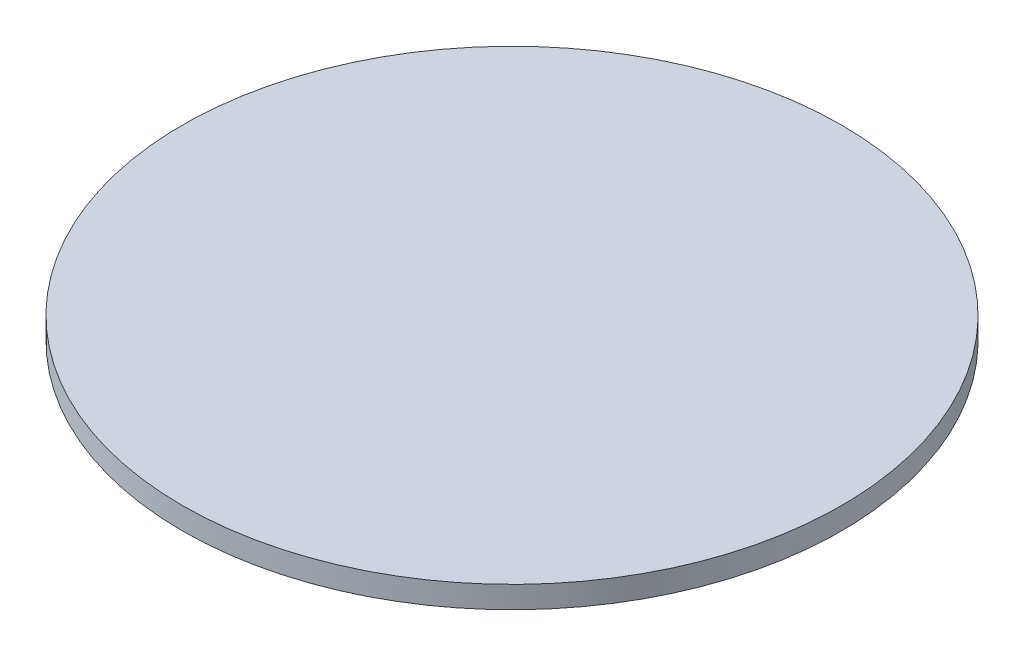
from build123d import *

# Parameters (mm, degrees)
SKETCH1_R           = 225
BOSS_EXTRUDE1_DEPTH = 15


with BuildPart() as part:
    # Sketch1 → Boss-Extrude1 (new body)
    with BuildSketch(Plane(origin=(0, 0, 0), x_dir=(1, 0, 0), z_dir=(0, 1, 0))):
        with Locations(Location((0, 0, 0), (0, 0, 270))):
            Circle(SKETCH1_R)
    extrude(amount=BOSS_EXTRUDE1_DEPTH)


solid = part.part
